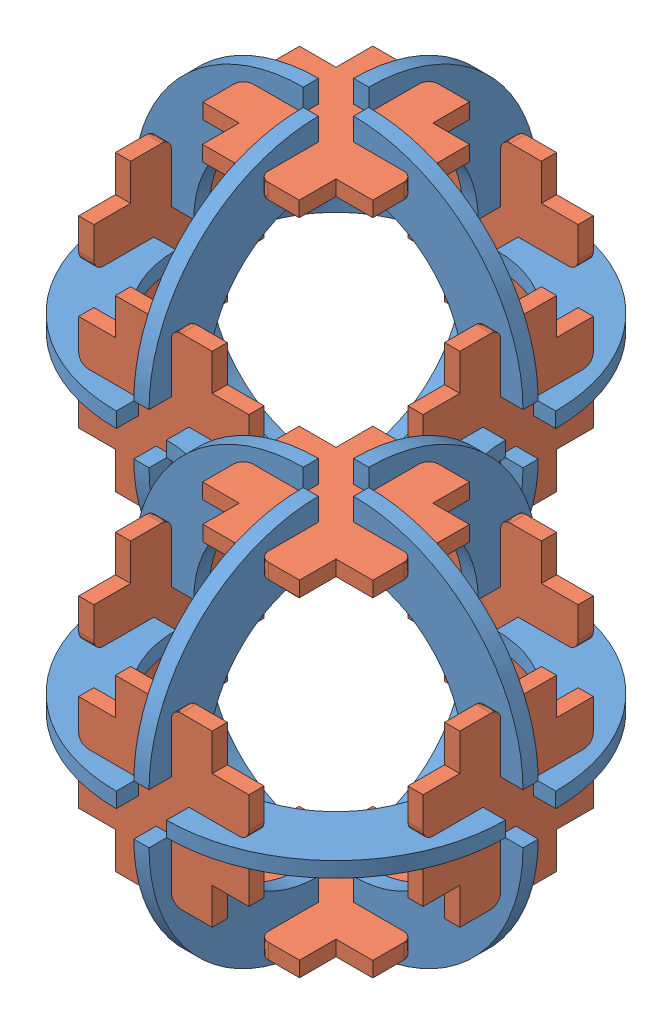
SolidWorks assembly Assem3.SLDASM, configuration Default (file format 9000). Lengths in mm.
Overall size (188.61 102.18 188.61).
38 component instances, 2 part files, 9 mates.
Components (placement in the parent):
- Assem2_1-1: Assem2_1.SLDASM [Default] at (-38.1832 89.1227 -219.1857) size (102.18 102.18 102.18)
  - Part3-1: Part3.SLDPRT [Default] at (66.9999 6.6894 9.7381) size (44.48 44.48 4)
  - Part4-1: Part4.SLDPRT [Default] at (35.5621 41.3002 12.7082) x (1 0 0) z (0 1 0) size (44.7 44.62 4)
  - Part3-3: Part3.SLDPRT [Default] at (24.8621 6.6894 55.8759) x (0 0 1) z (-1 0 0) size (44.48 44.48 4)
  - Part3-4: Part3.SLDPRT [Default] at (24.8621 -44.0524 18.3421) x (0 -1 0) z (-1 0 0) size (44.48 44.48 4)
  - Part4-3: Part4.SLDPRT [Default] at (35.5621 -0.8847 52.9529) size (44.7 44.62 4)
  - Part4-4: Part4.SLDPRT [Default] at (68.0769 -0.8847 24.4381) x (0 0 1) z (-1 0 0) size (44.7 44.62 4)
  - Part4-5: Part4.SLDPRT [Default] at (10.1621 -41.1294 12.7082) x (-1 0 0) z (0 -1 0) size (44.7 44.62 4)
  - Part3-7: Part3.SLDPRT [Default] at (20.8621 6.6894 -32.3997) x (0 0 -1) z (1 0 0) size (44.48 44.48 4)
  - Part4-6: Part4.SLDPRT [Default] at (35.5621 -0.8847 -33.4767) size (44.7 44.62 4)
  - Part3-8: Part3.SLDPRT [Default] at (29.4661 -44.0524 9.7381) x (0 -1 0) z (0 0 1) size (44.48 44.48 4)
  - Part3-9: Part3.SLDPRT [Default] at (66.9999 -1.9146 5.1341) x (1 0 0) z (0 1 0) size (44.48 44.48 4)
  - Part3-10: Part3.SLDPRT [Default] at (20.8621 -44.0524 5.1341) x (0 -1 0) z (1 0 0) size (44.48 44.48 4)
  - Part3-11: Part3.SLDPRT [Default] at (16.2581 44.2232 9.7381) x (0 1 0) z (0 0 1) size (44.48 44.48 4)
  - Part3-12: Part3.SLDPRT [Default] at (16.2581 2.0854 55.8759) x (0 0 1) z (0 -1 0) size (44.48 44.48 4)
  - Part4-7: Part4.SLDPRT [Default] at (-18.3527 -0.8847 24.4381) x (0 0 1) z (-1 0 0) size (44.7 44.62 4)
  - Part3-37: Part3.SLDPRT [Default] at (66.9999 2.0854 18.3421) x (1 0 0) z (0 -1 0) size (44.48 44.48 4)
  - Part3-38: Part3.SLDPRT [Default] at (-21.2757 -6.5186 9.7381) x (-1 0 0) z (0 0 1) size (44.48 44.48 4)
- Assem2_1-2: Assem2_1.SLDASM [Default] at (-90.0127 89.2935 -271.0152) x (0 0 -1) z (-1 0 0) size (102.18 102.18 102.18)
  - Part3-1: Part3.SLDPRT [Default] at (66.9999 6.6894 9.7381) size (44.48 44.48 4)
  - Part4-1: Part4.SLDPRT [Default] at (35.5621 41.3002 12.7082) x (1 0 0) z (0 1 0) size (44.7 44.62 4)
  - Part3-3: Part3.SLDPRT [Default] at (24.8621 6.6894 55.8759) x (0 0 1) z (-1 0 0) size (44.48 44.48 4)
  - Part3-4: Part3.SLDPRT [Default] at (24.8621 -44.0524 18.3421) x (0 -1 0) z (-1 0 0) size (44.48 44.48 4)
  - Part4-3: Part4.SLDPRT [Default] at (35.5621 -0.8847 52.9529) size (44.7 44.62 4)
  - Part4-4: Part4.SLDPRT [Default] at (68.0769 -0.8847 24.4381) x (0 0 1) z (-1 0 0) size (44.7 44.62 4)
  - Part4-5: Part4.SLDPRT [Default] at (10.1621 -41.1294 12.7082) x (-1 0 0) z (0 -1 0) size (44.7 44.62 4)
  - Part3-7: Part3.SLDPRT [Default] at (20.8621 6.6894 -32.3997) x (0 0 -1) z (1 0 0) size (44.48 44.48 4)
  - Part4-6: Part4.SLDPRT [Default] at (35.5621 -0.8847 -33.4767) size (44.7 44.62 4)
  - Part3-8: Part3.SLDPRT [Default] at (29.4661 -44.0524 9.7381) x (0 -1 0) z (0 0 1) size (44.48 44.48 4)
  - Part3-9: Part3.SLDPRT [Default] at (66.9999 -1.9146 5.1341) x (1 0 0) z (0 1 0) size (44.48 44.48 4)
  - Part3-10: Part3.SLDPRT [Default] at (20.8621 -44.0524 5.1341) x (0 -1 0) z (1 0 0) size (44.48 44.48 4)
  - Part3-11: Part3.SLDPRT [Default] at (16.2581 44.2232 9.7381) x (0 1 0) z (0 0 1) size (44.48 44.48 4)
  - Part3-12: Part3.SLDPRT [Default] at (16.2581 2.0854 55.8759) x (0 0 1) z (0 -1 0) size (44.48 44.48 4)
  - Part4-7: Part4.SLDPRT [Default] at (-18.3527 -0.8847 24.4381) x (0 0 1) z (-1 0 0) size (44.7 44.62 4)
  - Part3-37: Part3.SLDPRT [Default] at (66.9999 2.0854 18.3421) x (1 0 0) z (0 -1 0) size (44.48 44.48 4)
  - Part3-38: Part3.SLDPRT [Default] at (-21.2757 -6.5186 9.7381) x (-1 0 0) z (0 0 1) size (44.48 44.48 4)
- Part3-2: Part3.SLDPRT [Default] at (-59.459 87.2081 -287.2733) x (-1 0 0) z (0 1 0) size (44.48 44.48 4)
- Part3-3: Part3.SLDPRT [Default] at (-95.1468 91.2081 -251.5854) x (0 0 -1) z (0 -1 0) size (44.48 44.48 4)
Mates (geometry in assembly coordinates):
- Coincident4: coincident anti-aligned: plane of Assem2_1-1/Part4-6 through (-28.0212 88.238 -248.6625) normal (-1 0 0); plane of Part3-2 through (-28.0212 91.2081 -252.6625) normal (1 0 0)
- Coincident5: coincident anti-aligned: plane of Assem2_1-1/Part4-6 through (-2.6212 87.2081 -248.6625) normal (0 1 0); plane of Part3-2 through (-21.9252 87.2081 -287.2733) normal (0 -1 0)
- Coincident6: coincident anti-aligned: plane of Assem2_1-1/Part4-6 through (-2.6212 88.238 -248.6625) normal (0 0 1); plane of Part3-2 through (-28.0212 91.2081 -248.6625) normal (0 0 -1)
- Coincident15: coincident anti-aligned: plane of Assem2_1-2/Part4-6 through (-56.536 90.1783 -306.5773) normal (1 0 0); plane of Part3-2 through (-56.536 91.2081 -287.2733) normal (-1 0 0)
- Coincident16: coincident anti-aligned: plane of Assem2_1-2/Part4-6 through (-60.536 90.1783 -281.1773) normal (0 0 1); plane of Part3-2 through (-56.536 91.2081 -281.1773) normal (0 0 -1)
- Coincident17: coincident anti-aligned: plane of Assem2_1-2/Part4-6 through (-60.536 91.2081 -306.5773) normal (0 -1 0); plane of Part3-2 through (-21.9252 91.2081 -287.2733) normal (0 1 0)
- Coincident18: coincident: plane of Assem2_1-1/Part4-7 through (-60.536 91.2081 -194.7476) normal (0 -1 0); plane of Part3-3 through (-281.7542 91.2081 -214.0516) normal (0 1 0)
- Coincident19: coincident: plane of Assem2_1-1/Part4-7 through (-60.536 88.238 -220.1476) normal (0 0 -1); plane of Part3-3 through (-247.1433 87.2081 -220.1476) normal (0 0 1)
- Coincident20: coincident anti-aligned: plane of Assem2_1-1/Part4-7 through (-56.536 88.238 -194.7476) normal (1 0 0); plane of Part3-3 through (-56.536 87.2081 -220.1476) normal (-1 0 0)
